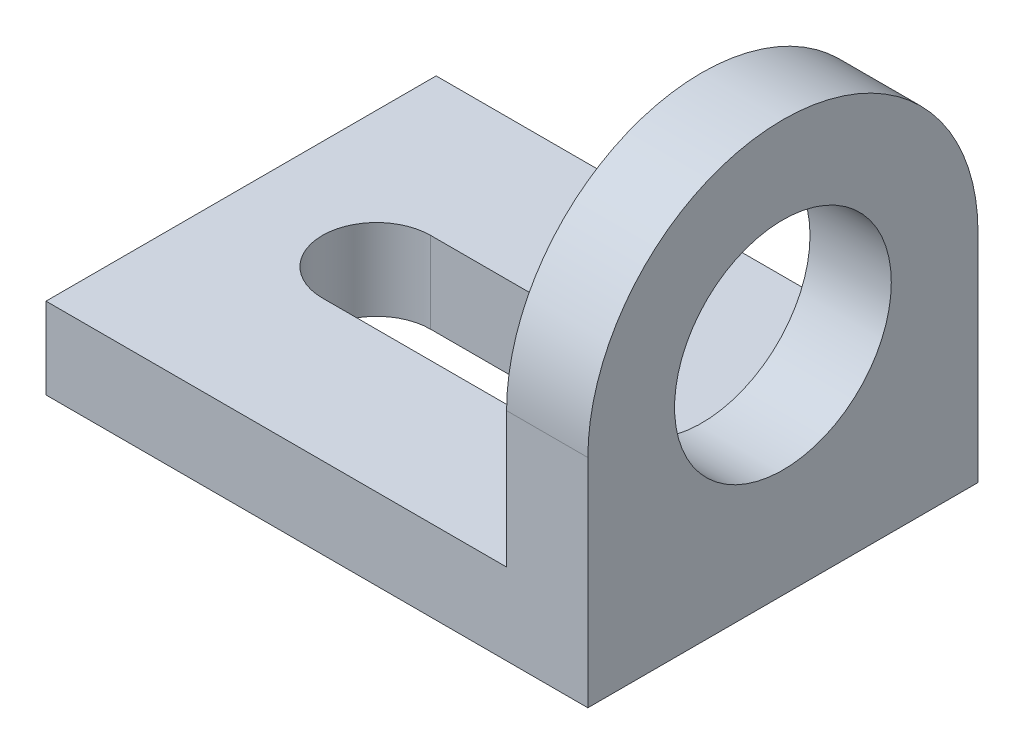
from build123d import *

# Parameters (mm, degrees)
SKETCH_1_W      = 100
SKETCH_1_H      = 72
EXTRUDE_1_DEPTH = 15
SKETCH_2_R      = 20
EXTRUDE_2_DEPTH = 15


with BuildPart() as part:
    # Sketch 1 → Extrude 1 (new body)
    with BuildSketch(Plane(origin=(0, 0, 0), x_dir=(1, 0, 0), z_dir=(0, 1, 0))):
        with Locations((-50, 0)):
            Rectangle(SKETCH_1_W, SKETCH_1_H)
        with BuildLine():
            Line((-75, 10), (-35, 10))
            ThreePointArc((-35, 10), (-25, 0), (-35, -10))
            Line((-35, -10), (-75, -10))
            ThreePointArc((-75, -10), (-85, 0), (-75, 10))
        make_face(mode=Mode.SUBTRACT)
    extrude(amount=EXTRUDE_1_DEPTH)

    # Sketch 2 → Extrude 2 (add)
    with BuildSketch(Plane(origin=(0, 0, 0), x_dir=(0, 0, -1), z_dir=(1, 0, 0))):
        with BuildLine():
            Line((-36, 15), (-36, 40))
            ThreePointArc((-36, 40), (0, 76), (36, 40))
            Line((36, 40), (36, 15))
            Line((36, 15), (-36, 15))
        make_face()
        with Locations((0, 40)):
            Circle(SKETCH_2_R, mode=Mode.SUBTRACT)
    extrude(amount=-EXTRUDE_2_DEPTH)


solid = part.part
